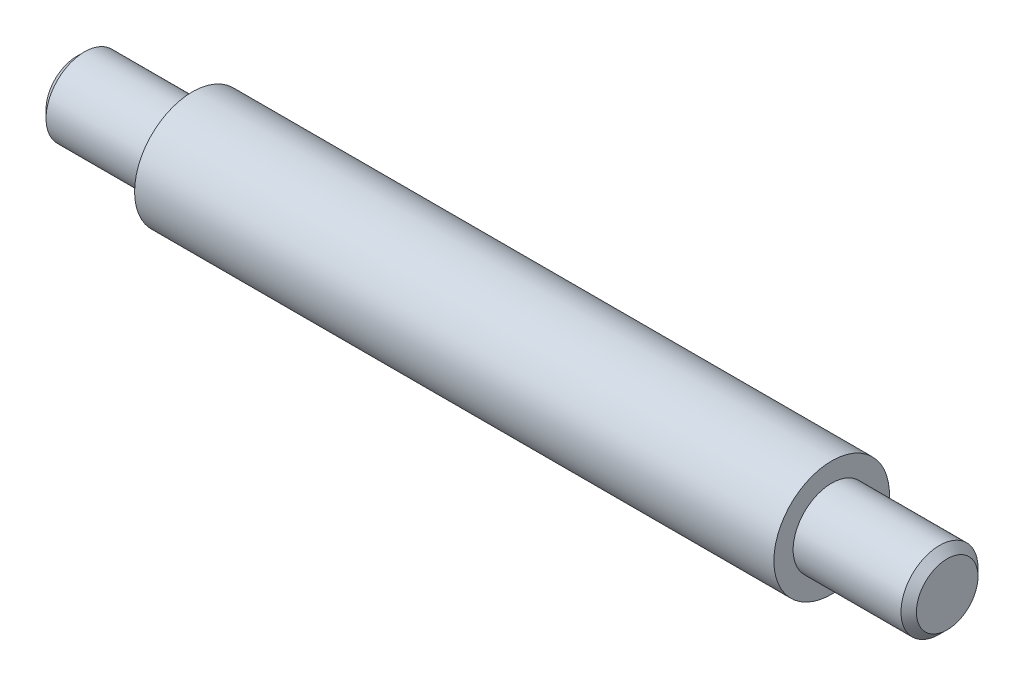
ISO-10303-21;
HEADER;
FILE_DESCRIPTION(('STEP AP214'),'2;1');
FILE_NAME('part.step','',(''),(''),'','','');
FILE_SCHEMA(('AUTOMOTIVE_DESIGN { 1 0 10303 214 1 1 1 1 }'));
ENDSEC;
DATA;
#1=APPLICATION_CONTEXT('core data for automotive mechanical design processes');
#2=APPLICATION_PROTOCOL_DEFINITION('international standard','automotive_design',2000,#1);
#3=PRODUCT_CONTEXT('',#1,'mechanical');
#4=PRODUCT('Part','Part','',(#3));
#5=PRODUCT_RELATED_PRODUCT_CATEGORY('part','',(#4));
#6=PRODUCT_DEFINITION_FORMATION('','',#4);
#7=PRODUCT_DEFINITION_CONTEXT('part definition',#1,'design');
#8=PRODUCT_DEFINITION('design','',#6,#7);
#9=PRODUCT_DEFINITION_SHAPE('','',#8);
#10=(LENGTH_UNIT() NAMED_UNIT(*) SI_UNIT(.MILLI.,.METRE.));
#11=(NAMED_UNIT(*) PLANE_ANGLE_UNIT() SI_UNIT($,.RADIAN.));
#12=(NAMED_UNIT(*) SI_UNIT($,.STERADIAN.) SOLID_ANGLE_UNIT());
#13=UNCERTAINTY_MEASURE_WITH_UNIT(LENGTH_MEASURE(1.E-05),#10,'distance_accuracy_value','');
#14=(GEOMETRIC_REPRESENTATION_CONTEXT(3) GLOBAL_UNCERTAINTY_ASSIGNED_CONTEXT((#13)) GLOBAL_UNIT_ASSIGNED_CONTEXT((#10,
#11,#12)) REPRESENTATION_CONTEXT('',''));
#15=CARTESIAN_POINT('',(0.,0.,0.));
#16=DIRECTION('',(0.,0.,1.));
#17=DIRECTION('',(1.,0.,0.));
#18=AXIS2_PLACEMENT_3D('',#15,#16,#17);
#19=CARTESIAN_POINT('',(9.8,0.,0.));
#20=DIRECTION('',(1.,0.,0.));
#21=DIRECTION('',(0.,0.,-1.));
#22=AXIS2_PLACEMENT_3D('',#19,#20,#21);
#23=PLANE('',#22);
#24=CARTESIAN_POINT('',(9.8,0.,0.));
#25=DIRECTION('',(1.,0.,0.));
#26=DIRECTION('',(0.,0.,-1.));
#27=AXIS2_PLACEMENT_3D('',#24,#25,#26);
#28=CIRCLE('',#27,0.75);
#29=CARTESIAN_POINT('',(9.8,0.,0.75));
#30=VERTEX_POINT('',#29);
#31=EDGE_CURVE('E55',#30,#30,#28,.T.);
#32=ORIENTED_EDGE('',*,*,#31,.T.);
#33=EDGE_LOOP('',(#32));
#34=FACE_BOUND('',#33,.T.);
#35=CARTESIAN_POINT('',(9.8,0.,0.));
#36=DIRECTION('',(1.,0.,0.));
#37=DIRECTION('',(0.,0.,-1.));
#38=AXIS2_PLACEMENT_3D('',#35,#36,#37);
#39=CIRCLE('',#38,0.5);
#40=CARTESIAN_POINT('',(9.8,0.,-0.5));
#41=VERTEX_POINT('',#40);
#42=EDGE_CURVE('E61',#41,#41,#39,.T.);
#43=ORIENTED_EDGE('',*,*,#42,.F.);
#44=EDGE_LOOP('',(#43));
#45=FACE_BOUND('',#44,.T.);
#46=ADVANCED_FACE('F32',(#34,#45),#23,.T.);
#47=CARTESIAN_POINT('',(1.5,0.,0.));
#48=DIRECTION('',(-1.,0.,0.));
#49=DIRECTION('',(0.,0.,1.));
#50=AXIS2_PLACEMENT_3D('',#47,#48,#49);
#51=CYLINDRICAL_SURFACE('',#50,0.5);
#52=CARTESIAN_POINT('',(0.0999999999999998,0.,0.));
#53=DIRECTION('',(1.,0.,0.));
#54=DIRECTION('',(0.,0.,-1.));
#55=AXIS2_PLACEMENT_3D('',#52,#53,#54);
#56=CIRCLE('',#55,0.5);
#57=CARTESIAN_POINT('',(0.0999999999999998,0.,-0.5));
#58=VERTEX_POINT('',#57);
#59=EDGE_CURVE('E39',#58,#58,#56,.T.);
#60=ORIENTED_EDGE('',*,*,#59,.T.);
#61=EDGE_LOOP('',(#60));
#62=FACE_BOUND('',#61,.T.);
#63=CARTESIAN_POINT('',(1.5,0.,0.));
#64=DIRECTION('',(1.,0.,0.));
#65=DIRECTION('',(0.,0.,-1.));
#66=AXIS2_PLACEMENT_3D('',#63,#64,#65);
#67=CIRCLE('',#66,0.5);
#68=CARTESIAN_POINT('',(1.5,0.,-0.5));
#69=VERTEX_POINT('',#68);
#70=EDGE_CURVE('E52',#69,#69,#67,.T.);
#71=ORIENTED_EDGE('',*,*,#70,.F.);
#72=EDGE_LOOP('',(#71));
#73=FACE_BOUND('',#72,.T.);
#74=ADVANCED_FACE('F34',(#62,#73),#51,.T.);
#75=CARTESIAN_POINT('',(0.,0.,0.));
#76=DIRECTION('',(1.,0.,0.));
#77=DIRECTION('',(0.,0.,-1.));
#78=AXIS2_PLACEMENT_3D('',#75,#76,#77);
#79=PLANE('',#78);
#80=CARTESIAN_POINT('',(0.,0.,0.));
#81=DIRECTION('',(1.,0.,0.));
#82=DIRECTION('',(0.,0.,-1.));
#83=AXIS2_PLACEMENT_3D('',#80,#81,#82);
#84=CIRCLE('',#83,0.4);
#85=CARTESIAN_POINT('',(0.,0.,-0.4));
#86=VERTEX_POINT('',#85);
#87=EDGE_CURVE('E10',#86,#86,#84,.F.);
#88=ORIENTED_EDGE('',*,*,#87,.T.);
#89=EDGE_LOOP('',(#88));
#90=FACE_BOUND('',#89,.T.);
#91=ADVANCED_FACE('F73',(#90),#79,.F.);
#92=CARTESIAN_POINT('',(1.5,0.,0.));
#93=DIRECTION('',(1.,0.,0.));
#94=DIRECTION('',(0.,0.,-1.));
#95=AXIS2_PLACEMENT_3D('',#92,#93,#94);
#96=PLANE('',#95);
#97=CARTESIAN_POINT('',(1.5,0.,0.));
#98=DIRECTION('',(1.,0.,0.));
#99=DIRECTION('',(0.,0.,-1.));
#100=AXIS2_PLACEMENT_3D('',#97,#98,#99);
#101=CIRCLE('',#100,0.75);
#102=CARTESIAN_POINT('',(1.5,0.,0.75));
#103=VERTEX_POINT('',#102);
#104=EDGE_CURVE('E58',#103,#103,#101,.T.);
#105=ORIENTED_EDGE('',*,*,#104,.F.);
#106=EDGE_LOOP('',(#105));
#107=FACE_BOUND('',#106,.T.);
#108=ORIENTED_EDGE('',*,*,#70,.T.);
#109=EDGE_LOOP('',(#108));
#110=FACE_BOUND('',#109,.T.);
#111=ADVANCED_FACE('F76',(#107,#110),#96,.F.);
#112=CARTESIAN_POINT('',(9.8,0.,0.));
#113=DIRECTION('',(-1.,0.,0.));
#114=DIRECTION('',(0.,0.,1.));
#115=AXIS2_PLACEMENT_3D('',#112,#113,#114);
#116=CYLINDRICAL_SURFACE('',#115,0.75);
#117=CARTESIAN_POINT('',(9.8,0.,0.75));
#118=CARTESIAN_POINT('',(9.71354166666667,0.,0.75));
#119=CARTESIAN_POINT('',(9.62708333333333,0.,0.75));
#120=CARTESIAN_POINT('',(9.45416666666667,0.,0.75));
#121=CARTESIAN_POINT('',(9.36770833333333,0.,0.75));
#122=CARTESIAN_POINT('',(9.19479166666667,0.,0.75));
#123=CARTESIAN_POINT('',(9.10833333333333,0.,0.75));
#124=CARTESIAN_POINT('',(8.93541666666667,0.,0.75));
#125=CARTESIAN_POINT('',(8.84895833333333,0.,0.75));
#126=CARTESIAN_POINT('',(8.67604166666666,0.,0.75));
#127=CARTESIAN_POINT('',(8.58958333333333,0.,0.75));
#128=CARTESIAN_POINT('',(8.41666666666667,0.,0.75));
#129=CARTESIAN_POINT('',(8.33020833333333,0.,0.75));
#130=CARTESIAN_POINT('',(8.15729166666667,0.,0.75));
#131=CARTESIAN_POINT('',(8.07083333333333,0.,0.75));
#132=CARTESIAN_POINT('',(7.89791666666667,0.,0.75));
#133=CARTESIAN_POINT('',(7.81145833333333,0.,0.75));
#134=CARTESIAN_POINT('',(7.63854166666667,0.,0.75));
#135=CARTESIAN_POINT('',(7.55208333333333,0.,0.75));
#136=CARTESIAN_POINT('',(7.37916666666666,0.,0.75));
#137=CARTESIAN_POINT('',(7.29270833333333,0.,0.75));
#138=CARTESIAN_POINT('',(7.11979166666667,0.,0.75));
#139=CARTESIAN_POINT('',(7.03333333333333,0.,0.75));
#140=CARTESIAN_POINT('',(6.86041666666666,0.,0.75));
#141=CARTESIAN_POINT('',(6.77395833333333,0.,0.75));
#142=CARTESIAN_POINT('',(6.60104166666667,0.,0.75));
#143=CARTESIAN_POINT('',(6.51458333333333,0.,0.75));
#144=CARTESIAN_POINT('',(6.34166666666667,0.,0.75));
#145=CARTESIAN_POINT('',(6.25520833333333,0.,0.75));
#146=CARTESIAN_POINT('',(6.08229166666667,0.,0.75));
#147=CARTESIAN_POINT('',(5.99583333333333,0.,0.75));
#148=CARTESIAN_POINT('',(5.82291666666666,0.,0.75));
#149=CARTESIAN_POINT('',(5.73645833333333,0.,0.75));
#150=CARTESIAN_POINT('',(5.56354166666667,0.,0.75));
#151=CARTESIAN_POINT('',(5.47708333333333,0.,0.75));
#152=CARTESIAN_POINT('',(5.30416666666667,0.,0.75));
#153=CARTESIAN_POINT('',(5.21770833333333,0.,0.75));
#154=CARTESIAN_POINT('',(5.04479166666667,0.,0.75));
#155=CARTESIAN_POINT('',(4.95833333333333,0.,0.75));
#156=CARTESIAN_POINT('',(4.78541666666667,0.,0.75));
#157=CARTESIAN_POINT('',(4.69895833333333,0.,0.75));
#158=CARTESIAN_POINT('',(4.52604166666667,0.,0.75));
#159=CARTESIAN_POINT('',(4.43958333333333,0.,0.75));
#160=CARTESIAN_POINT('',(4.26666666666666,0.,0.75));
#161=CARTESIAN_POINT('',(4.18020833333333,0.,0.75));
#162=CARTESIAN_POINT('',(4.00729166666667,0.,0.75));
#163=CARTESIAN_POINT('',(3.92083333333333,0.,0.75));
#164=CARTESIAN_POINT('',(3.74791666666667,0.,0.75));
#165=CARTESIAN_POINT('',(3.66145833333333,0.,0.75));
#166=CARTESIAN_POINT('',(3.48854166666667,0.,0.75));
#167=CARTESIAN_POINT('',(3.40208333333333,0.,0.75));
#168=CARTESIAN_POINT('',(3.22916666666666,0.,0.75));
#169=CARTESIAN_POINT('',(3.14270833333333,0.,0.75));
#170=CARTESIAN_POINT('',(2.96979166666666,0.,0.75));
#171=CARTESIAN_POINT('',(2.88333333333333,0.,0.75));
#172=CARTESIAN_POINT('',(2.71041666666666,0.,0.75));
#173=CARTESIAN_POINT('',(2.62395833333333,0.,0.75));
#174=CARTESIAN_POINT('',(2.45104166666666,0.,0.75));
#175=CARTESIAN_POINT('',(2.36458333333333,0.,0.75));
#176=CARTESIAN_POINT('',(2.19166666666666,0.,0.75));
#177=CARTESIAN_POINT('',(2.10520833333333,0.,0.75));
#178=CARTESIAN_POINT('',(1.93229166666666,0.,0.75));
#179=CARTESIAN_POINT('',(1.84583333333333,0.,0.75));
#180=CARTESIAN_POINT('',(1.67291666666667,0.,0.75));
#181=CARTESIAN_POINT('',(1.58645833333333,0.,0.75));
#182=CARTESIAN_POINT('',(1.5,0.,0.75));
#183=B_SPLINE_CURVE_WITH_KNOTS('',3,(#117,#118,#119,#120,#121,#122,#123,#124,#125,#126,#127,
#128,#129,#130,#131,#132,#133,#134,#135,#136,#137,#138,#139,#140,#141,#142,#143,#144,#145,#146,
#147,#148,#149,#150,#151,#152,#153,#154,#155,#156,#157,#158,#159,#160,#161,#162,#163,#164,#165,
#166,#167,#168,#169,#170,#171,#172,#173,#174,#175,#176,#177,#178,#179,#180,#181,#182),
.UNSPECIFIED.,.F.,.F.,(4,2,2,2,2,2,2,2,2,2,2,2,2,2,2,2,2,2,2,2,2,2,2,2,2,2,2,2,2,2,2,2,4),(0.,
0.259375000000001,0.51875,0.778125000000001,1.0375,1.296875,1.55625,1.815625,2.075,2.334375,
2.59375,2.853125,3.1125,3.371875,3.63125,3.890625,4.15,4.409375,4.66875,4.928125,5.1875,
5.446875,5.70625,5.965625,6.225,6.484375,6.74375,7.003125,7.2625,7.521875,7.78125,8.040625,8.3),.UNSPECIFIED.);
#184=EDGE_CURVE('BSEAM78',#30,#103,#183,.T.);
#185=ORIENTED_EDGE('',*,*,#31,.F.);
#186=ORIENTED_EDGE('',*,*,#104,.T.);
#187=ORIENTED_EDGE('',*,*,#184,.T.);
#188=ORIENTED_EDGE('',*,*,#184,.F.);
#189=EDGE_LOOP('',(#185,#187,#186,#188));
#190=FACE_BOUND('',#189,.T.);
#191=ADVANCED_FACE('F78',(#190),#116,.T.);
#192=CARTESIAN_POINT('',(11.3,0.,0.));
#193=DIRECTION('',(-1.,0.,0.));
#194=DIRECTION('',(0.,0.,1.));
#195=AXIS2_PLACEMENT_3D('',#192,#193,#194);
#196=CYLINDRICAL_SURFACE('',#195,0.5);
#197=CARTESIAN_POINT('',(11.2,0.,0.));
#198=DIRECTION('',(1.,0.,0.));
#199=DIRECTION('',(0.,0.,-1.));
#200=AXIS2_PLACEMENT_3D('',#197,#198,#199);
#201=CIRCLE('',#200,0.5);
#202=CARTESIAN_POINT('',(11.2,0.,-0.5));
#203=VERTEX_POINT('',#202);
#204=EDGE_CURVE('E43',#203,#203,#201,.F.);
#205=ORIENTED_EDGE('',*,*,#204,.T.);
#206=EDGE_LOOP('',(#205));
#207=FACE_BOUND('',#206,.T.);
#208=ORIENTED_EDGE('',*,*,#42,.T.);
#209=EDGE_LOOP('',(#208));
#210=FACE_BOUND('',#209,.T.);
#211=ADVANCED_FACE('F65',(#207,#210),#196,.T.);
#212=CARTESIAN_POINT('',(11.3,0.,0.));
#213=DIRECTION('',(1.,0.,0.));
#214=DIRECTION('',(0.,0.,-1.));
#215=AXIS2_PLACEMENT_3D('',#212,#213,#214);
#216=PLANE('',#215);
#217=CARTESIAN_POINT('',(11.3,0.,0.));
#218=DIRECTION('',(1.,0.,0.));
#219=DIRECTION('',(0.,0.,-1.));
#220=AXIS2_PLACEMENT_3D('',#217,#218,#219);
#221=CIRCLE('',#220,0.400000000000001);
#222=CARTESIAN_POINT('',(11.3,0.,-0.400000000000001));
#223=VERTEX_POINT('',#222);
#224=EDGE_CURVE('E47',#223,#223,#221,.T.);
#225=ORIENTED_EDGE('',*,*,#224,.T.);
#226=EDGE_LOOP('',(#225));
#227=FACE_BOUND('',#226,.T.);
#228=ADVANCED_FACE('F103',(#227),#216,.T.);
#229=CARTESIAN_POINT('',(11.3,0.,0.));
#230=DIRECTION('',(-1.,0.,0.));
#231=DIRECTION('',(0.,0.,1.));
#232=AXIS2_PLACEMENT_3D('',#229,#230,#231);
#233=CONICAL_SURFACE('',#232,0.400000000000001,0.78539816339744);
#234=ORIENTED_EDGE('',*,*,#204,.F.);
#235=EDGE_LOOP('',(#234));
#236=FACE_BOUND('',#235,.T.);
#237=ORIENTED_EDGE('',*,*,#224,.F.);
#238=EDGE_LOOP('',(#237));
#239=FACE_BOUND('',#238,.T.);
#240=ADVANCED_FACE('F110',(#236,#239),#233,.T.);
#241=CARTESIAN_POINT('',(0.0999999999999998,0.,0.));
#242=DIRECTION('',(1.,0.,0.));
#243=DIRECTION('',(0.,0.,-1.));
#244=AXIS2_PLACEMENT_3D('',#241,#242,#243);
#245=CONICAL_SURFACE('',#244,0.5,0.785398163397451);
#246=ORIENTED_EDGE('',*,*,#87,.F.);
#247=EDGE_LOOP('',(#246));
#248=FACE_BOUND('',#247,.T.);
#249=ORIENTED_EDGE('',*,*,#59,.F.);
#250=EDGE_LOOP('',(#249));
#251=FACE_BOUND('',#250,.T.);
#252=ADVANCED_FACE('F118',(#248,#251),#245,.T.);
#253=CLOSED_SHELL('',(#46,#74,#91,#111,#191,#211,#228,#240,#252));
#254=MANIFOLD_SOLID_BREP('B2',#253);
#255=ADVANCED_BREP_SHAPE_REPRESENTATION('',(#18,#254),#14);
#256=SHAPE_DEFINITION_REPRESENTATION(#9,#255);
ENDSEC;
END-ISO-10303-21;
